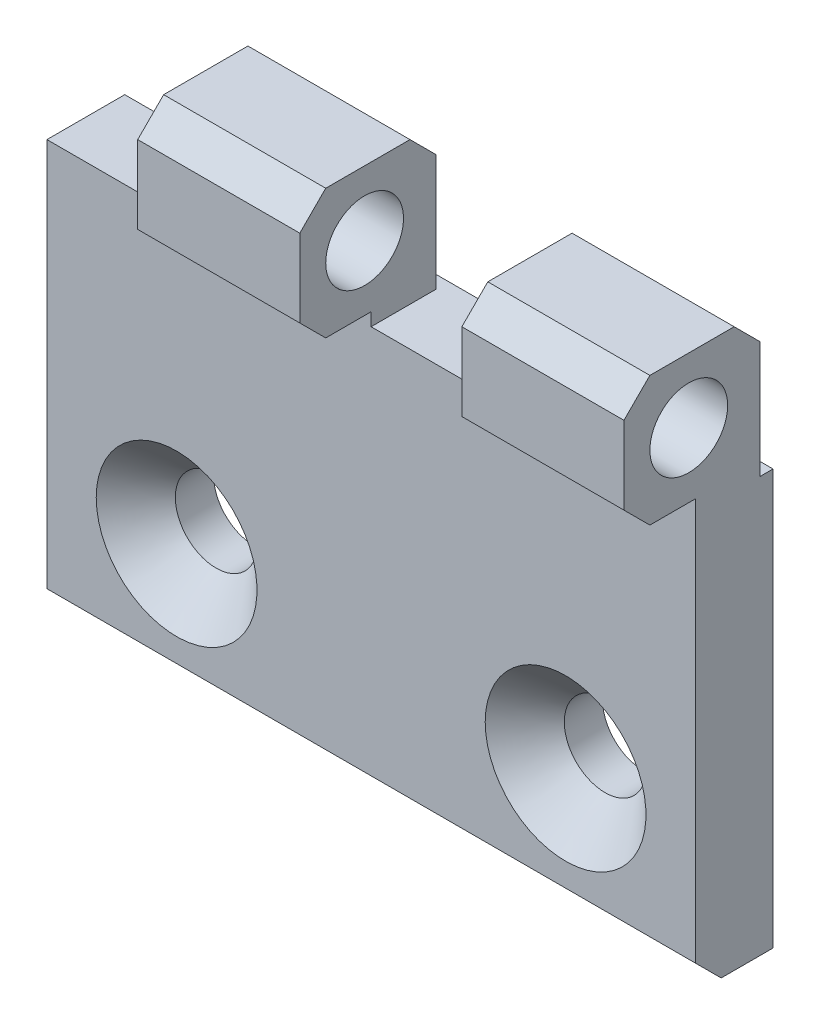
ISO-10303-21;
HEADER;
FILE_DESCRIPTION(('STEP AP214'),'2;1');
FILE_NAME('part.step','',(''),(''),'','','');
FILE_SCHEMA(('AUTOMOTIVE_DESIGN { 1 0 10303 214 1 1 1 1 }'));
ENDSEC;
DATA;
#1=APPLICATION_CONTEXT('core data for automotive mechanical design processes');
#2=APPLICATION_PROTOCOL_DEFINITION('international standard','automotive_design',2000,#1);
#3=PRODUCT_CONTEXT('',#1,'mechanical');
#4=PRODUCT('Part','Part','',(#3));
#5=PRODUCT_RELATED_PRODUCT_CATEGORY('part','',(#4));
#6=PRODUCT_DEFINITION_FORMATION('','',#4);
#7=PRODUCT_DEFINITION_CONTEXT('part definition',#1,'design');
#8=PRODUCT_DEFINITION('design','',#6,#7);
#9=PRODUCT_DEFINITION_SHAPE('','',#8);
#10=(LENGTH_UNIT() NAMED_UNIT(*) SI_UNIT(.MILLI.,.METRE.));
#11=(NAMED_UNIT(*) PLANE_ANGLE_UNIT() SI_UNIT($,.RADIAN.));
#12=(NAMED_UNIT(*) SI_UNIT($,.STERADIAN.) SOLID_ANGLE_UNIT());
#13=UNCERTAINTY_MEASURE_WITH_UNIT(LENGTH_MEASURE(1.E-05),#10,'distance_accuracy_value','');
#14=(GEOMETRIC_REPRESENTATION_CONTEXT(3) GLOBAL_UNCERTAINTY_ASSIGNED_CONTEXT((#13)) GLOBAL_UNIT_ASSIGNED_CONTEXT((#10,
#11,#12)) REPRESENTATION_CONTEXT('',''));
#15=CARTESIAN_POINT('',(0.,0.,0.));
#16=DIRECTION('',(0.,0.,1.));
#17=DIRECTION('',(1.,0.,0.));
#18=AXIS2_PLACEMENT_3D('',#15,#16,#17);
#19=CARTESIAN_POINT('',(-10.,-10.,6.));
#20=DIRECTION('',(0.,0.,-1.));
#21=DIRECTION('',(-1.,0.,0.));
#22=AXIS2_PLACEMENT_3D('',#19,#20,#21);
#23=PLANE('',#22);
#24=CARTESIAN_POINT('',(30.,0.,6.));
#25=DIRECTION('',(0.,0.,-1.));
#26=DIRECTION('',(-1.,0.,0.));
#27=AXIS2_PLACEMENT_3D('',#24,#25,#26);
#28=CIRCLE('',#27,6.2);
#29=CARTESIAN_POINT('',(23.8,0.,6.));
#30=VERTEX_POINT('',#29);
#31=EDGE_CURVE('E348',#30,#30,#28,.T.);
#32=ORIENTED_EDGE('',*,*,#31,.T.);
#33=EDGE_LOOP('',(#32));
#34=FACE_BOUND('',#33,.T.);
#35=CARTESIAN_POINT('',(0.,0.,6.));
#36=DIRECTION('',(0.,0.,-1.));
#37=DIRECTION('',(-1.,0.,0.));
#38=AXIS2_PLACEMENT_3D('',#35,#36,#37);
#39=CIRCLE('',#38,6.2);
#40=CARTESIAN_POINT('',(-6.2,0.,6.));
#41=VERTEX_POINT('',#40);
#42=EDGE_CURVE('E341',#41,#41,#39,.T.);
#43=ORIENTED_EDGE('',*,*,#42,.T.);
#44=EDGE_LOOP('',(#43));
#45=FACE_BOUND('',#44,.T.);
#46=DIRECTION('',(0.,1.,0.));
#47=VECTOR('',#46,1.);
#48=CARTESIAN_POINT('',(27.5,-10.,6.));
#49=LINE('',#48,#47);
#50=CARTESIAN_POINT('',(27.5,22.,6.));
#51=VERTEX_POINT('',#50);
#52=CARTESIAN_POINT('',(27.5,23.,6.));
#53=VERTEX_POINT('',#52);
#54=EDGE_CURVE('E267',#51,#53,#49,.T.);
#55=ORIENTED_EDGE('',*,*,#54,.F.);
#56=DIRECTION('',(-1.,0.,0.));
#57=VECTOR('',#56,1.);
#58=CARTESIAN_POINT('',(-10.,22.,6.));
#59=LINE('',#58,#57);
#60=CARTESIAN_POINT('',(15.,22.,6.));
#61=VERTEX_POINT('',#60);
#62=EDGE_CURVE('E272',#51,#61,#59,.T.);
#63=ORIENTED_EDGE('',*,*,#62,.T.);
#64=DIRECTION('',(0.,1.,0.));
#65=VECTOR('',#64,1.);
#66=CARTESIAN_POINT('',(15.,-10.,6.));
#67=LINE('',#66,#65);
#68=CARTESIAN_POINT('',(15.,23.,6.));
#69=VERTEX_POINT('',#68);
#70=EDGE_CURVE('E257',#61,#69,#67,.T.);
#71=ORIENTED_EDGE('',*,*,#70,.T.);
#72=DIRECTION('',(1.,0.,0.));
#73=VECTOR('',#72,1.);
#74=CARTESIAN_POINT('',(-10.,23.,6.));
#75=LINE('',#74,#73);
#76=CARTESIAN_POINT('',(2.5,23.,6.));
#77=VERTEX_POINT('',#76);
#78=EDGE_CURVE('E316',#77,#69,#75,.T.);
#79=ORIENTED_EDGE('',*,*,#78,.F.);
#80=DIRECTION('',(0.,1.,0.));
#81=VECTOR('',#80,1.);
#82=CARTESIAN_POINT('',(2.5,-10.,6.));
#83=LINE('',#82,#81);
#84=CARTESIAN_POINT('',(2.5,22.,6.));
#85=VERTEX_POINT('',#84);
#86=EDGE_CURVE('E250',#85,#77,#83,.T.);
#87=ORIENTED_EDGE('',*,*,#86,.F.);
#88=DIRECTION('',(-1.,0.,0.));
#89=VECTOR('',#88,1.);
#90=CARTESIAN_POINT('',(-10.,22.,6.));
#91=LINE('',#90,#89);
#92=CARTESIAN_POINT('',(-10.,22.,6.));
#93=VERTEX_POINT('',#92);
#94=EDGE_CURVE('E269',#85,#93,#91,.T.);
#95=ORIENTED_EDGE('',*,*,#94,.T.);
#96=DIRECTION('',(0.,1.,0.));
#97=VECTOR('',#96,1.);
#98=CARTESIAN_POINT('',(-10.,-10.,6.));
#99=LINE('',#98,#97);
#100=CARTESIAN_POINT('',(-10.,-8.,6.));
#101=VERTEX_POINT('',#100);
#102=EDGE_CURVE('E298',#101,#93,#99,.T.);
#103=ORIENTED_EDGE('',*,*,#102,.F.);
#104=DIRECTION('',(1.,0.,0.));
#105=VECTOR('',#104,1.);
#106=CARTESIAN_POINT('',(-10.,-8.,6.));
#107=LINE('',#106,#105);
#108=CARTESIAN_POINT('',(40.,-8.,6.));
#109=VERTEX_POINT('',#108);
#110=EDGE_CURVE('E317',#101,#109,#107,.T.);
#111=ORIENTED_EDGE('',*,*,#110,.T.);
#112=DIRECTION('',(0.,1.,0.));
#113=VECTOR('',#112,1.);
#114=CARTESIAN_POINT('',(40.,-10.,6.));
#115=LINE('',#114,#113);
#116=CARTESIAN_POINT('',(40.,23.,6.));
#117=VERTEX_POINT('',#116);
#118=EDGE_CURVE('E278',#109,#117,#115,.T.);
#119=ORIENTED_EDGE('',*,*,#118,.T.);
#120=EDGE_CURVE('E314',#53,#117,#75,.T.);
#121=ORIENTED_EDGE('',*,*,#120,.F.);
#122=EDGE_LOOP('',(#55,#63,#71,#79,#87,#95,#103,#111,#119,#121));
#123=FACE_BOUND('',#122,.T.);
#124=ADVANCED_FACE('F14',(#34,#45,#123),#23,.F.);
#125=CARTESIAN_POINT('',(-10.,23.,11.));
#126=DIRECTION('',(0.,-1.,0.));
#127=DIRECTION('',(1.,0.,0.));
#128=AXIS2_PLACEMENT_3D('',#125,#126,#127);
#129=PLANE('',#128);
#130=DIRECTION('',(0.,0.,-1.));
#131=VECTOR('',#130,1.);
#132=CARTESIAN_POINT('',(40.,23.,11.));
#133=LINE('',#132,#131);
#134=CARTESIAN_POINT('',(40.,23.,9.5));
#135=VERTEX_POINT('',#134);
#136=EDGE_CURVE('E281',#135,#117,#133,.T.);
#137=ORIENTED_EDGE('',*,*,#136,.F.);
#138=DIRECTION('',(1.,0.,0.));
#139=VECTOR('',#138,1.);
#140=CARTESIAN_POINT('',(27.5,23.,9.5));
#141=LINE('',#140,#139);
#142=CARTESIAN_POINT('',(27.5,23.,9.5));
#143=VERTEX_POINT('',#142);
#144=EDGE_CURVE('E227',#143,#135,#141,.T.);
#145=ORIENTED_EDGE('',*,*,#144,.F.);
#146=DIRECTION('',(0.,0.,-1.));
#147=VECTOR('',#146,1.);
#148=CARTESIAN_POINT('',(27.5,23.,11.));
#149=LINE('',#148,#147);
#150=EDGE_CURVE('E264',#143,#53,#149,.T.);
#151=ORIENTED_EDGE('',*,*,#150,.T.);
#152=ORIENTED_EDGE('',*,*,#120,.T.);
#153=EDGE_LOOP('',(#137,#145,#151,#152));
#154=FACE_BOUND('',#153,.T.);
#155=ADVANCED_FACE('F367',(#154),#129,.T.);
#156=DIRECTION('',(0.,0.,-1.));
#157=VECTOR('',#156,1.);
#158=CARTESIAN_POINT('',(15.,23.,11.));
#159=LINE('',#158,#157);
#160=CARTESIAN_POINT('',(15.,23.,9.5));
#161=VERTEX_POINT('',#160);
#162=EDGE_CURVE('E255',#161,#69,#159,.T.);
#163=ORIENTED_EDGE('',*,*,#162,.F.);
#164=DIRECTION('',(1.,0.,0.));
#165=VECTOR('',#164,1.);
#166=CARTESIAN_POINT('',(2.5,23.,9.5));
#167=LINE('',#166,#165);
#168=CARTESIAN_POINT('',(2.5,23.,9.5));
#169=VERTEX_POINT('',#168);
#170=EDGE_CURVE('E202',#169,#161,#167,.T.);
#171=ORIENTED_EDGE('',*,*,#170,.F.);
#172=DIRECTION('',(0.,0.,-1.));
#173=VECTOR('',#172,1.);
#174=CARTESIAN_POINT('',(2.5,23.,11.));
#175=LINE('',#174,#173);
#176=EDGE_CURVE('E170',#169,#77,#175,.T.);
#177=ORIENTED_EDGE('',*,*,#176,.T.);
#178=ORIENTED_EDGE('',*,*,#78,.T.);
#179=EDGE_LOOP('',(#163,#171,#177,#178));
#180=FACE_BOUND('',#179,.T.);
#181=ADVANCED_FACE('F427',(#180),#129,.T.);
#182=CARTESIAN_POINT('',(-10.,33.,1.));
#183=DIRECTION('',(0.,1.,0.));
#184=DIRECTION('',(-1.,0.,0.));
#185=AXIS2_PLACEMENT_3D('',#182,#183,#184);
#186=PLANE('',#185);
#187=DIRECTION('',(-1.,0.,0.));
#188=VECTOR('',#187,1.);
#189=CARTESIAN_POINT('',(-10.,33.,3.));
#190=LINE('',#189,#188);
#191=CARTESIAN_POINT('',(40.,33.,3.));
#192=VERTEX_POINT('',#191);
#193=CARTESIAN_POINT('',(27.5,33.,3.));
#194=VERTEX_POINT('',#193);
#195=EDGE_CURVE('E328',#192,#194,#190,.T.);
#196=ORIENTED_EDGE('',*,*,#195,.T.);
#197=DIRECTION('',(0.,0.,1.));
#198=VECTOR('',#197,1.);
#199=CARTESIAN_POINT('',(27.5,33.,1.));
#200=LINE('',#199,#198);
#201=CARTESIAN_POINT('',(27.5,33.,9.5));
#202=VERTEX_POINT('',#201);
#203=EDGE_CURVE('E262',#194,#202,#200,.T.);
#204=ORIENTED_EDGE('',*,*,#203,.T.);
#205=DIRECTION('',(1.,0.,0.));
#206=VECTOR('',#205,1.);
#207=CARTESIAN_POINT('',(27.5,33.,9.5));
#208=LINE('',#207,#206);
#209=CARTESIAN_POINT('',(40.,33.,9.5));
#210=VERTEX_POINT('',#209);
#211=EDGE_CURVE('E219',#202,#210,#208,.T.);
#212=ORIENTED_EDGE('',*,*,#211,.T.);
#213=DIRECTION('',(0.,0.,1.));
#214=VECTOR('',#213,1.);
#215=CARTESIAN_POINT('',(40.,33.,1.));
#216=LINE('',#215,#214);
#217=EDGE_CURVE('E284',#192,#210,#216,.T.);
#218=ORIENTED_EDGE('',*,*,#217,.F.);
#219=EDGE_LOOP('',(#196,#204,#212,#218));
#220=FACE_BOUND('',#219,.T.);
#221=ADVANCED_FACE('F398',(#220),#186,.T.);
#222=DIRECTION('',(0.,0.,1.));
#223=VECTOR('',#222,1.);
#224=CARTESIAN_POINT('',(15.,33.,1.));
#225=LINE('',#224,#223);
#226=CARTESIAN_POINT('',(15.,33.,3.));
#227=VERTEX_POINT('',#226);
#228=CARTESIAN_POINT('',(15.,33.,9.5));
#229=VERTEX_POINT('',#228);
#230=EDGE_CURVE('E253',#227,#229,#225,.T.);
#231=ORIENTED_EDGE('',*,*,#230,.F.);
#232=CARTESIAN_POINT('',(2.5,33.,3.));
#233=VERTEX_POINT('',#232);
#234=EDGE_CURVE('E169',#227,#233,#190,.T.);
#235=ORIENTED_EDGE('',*,*,#234,.T.);
#236=DIRECTION('',(0.,0.,1.));
#237=VECTOR('',#236,1.);
#238=CARTESIAN_POINT('',(2.5,33.,1.));
#239=LINE('',#238,#237);
#240=CARTESIAN_POINT('',(2.5,33.,9.5));
#241=VERTEX_POINT('',#240);
#242=EDGE_CURVE('E37',#233,#241,#239,.T.);
#243=ORIENTED_EDGE('',*,*,#242,.T.);
#244=DIRECTION('',(1.,0.,0.));
#245=VECTOR('',#244,1.);
#246=CARTESIAN_POINT('',(2.5,33.,9.5));
#247=LINE('',#246,#245);
#248=EDGE_CURVE('E166',#241,#229,#247,.T.);
#249=ORIENTED_EDGE('',*,*,#248,.T.);
#250=EDGE_LOOP('',(#231,#235,#243,#249));
#251=FACE_BOUND('',#250,.T.);
#252=ADVANCED_FACE('F165',(#251),#186,.T.);
#253=CARTESIAN_POINT('',(-10.,33.,1.));
#254=DIRECTION('',(0.,0.,1.));
#255=DIRECTION('',(0.,-1.,0.));
#256=AXIS2_PLACEMENT_3D('',#253,#254,#255);
#257=PLANE('',#256);
#258=DIRECTION('',(0.,-1.,0.));
#259=VECTOR('',#258,1.);
#260=CARTESIAN_POINT('',(27.5,33.,1.));
#261=LINE('',#260,#259);
#262=CARTESIAN_POINT('',(27.5,31.,1.));
#263=VERTEX_POINT('',#262);
#264=CARTESIAN_POINT('',(27.5,22.,1.));
#265=VERTEX_POINT('',#264);
#266=EDGE_CURVE('E260',#263,#265,#261,.T.);
#267=ORIENTED_EDGE('',*,*,#266,.F.);
#268=DIRECTION('',(1.,0.,0.));
#269=VECTOR('',#268,1.);
#270=CARTESIAN_POINT('',(40.,31.,1.));
#271=LINE('',#270,#269);
#272=CARTESIAN_POINT('',(40.,31.,1.));
#273=VERTEX_POINT('',#272);
#274=EDGE_CURVE('E331',#263,#273,#271,.T.);
#275=ORIENTED_EDGE('',*,*,#274,.T.);
#276=DIRECTION('',(0.,-1.,0.));
#277=VECTOR('',#276,1.);
#278=CARTESIAN_POINT('',(40.,33.,1.));
#279=LINE('',#278,#277);
#280=CARTESIAN_POINT('',(40.,22.,1.));
#281=VERTEX_POINT('',#280);
#282=EDGE_CURVE('E286',#273,#281,#279,.T.);
#283=ORIENTED_EDGE('',*,*,#282,.T.);
#284=DIRECTION('',(1.,0.,0.));
#285=VECTOR('',#284,1.);
#286=CARTESIAN_POINT('',(-10.,22.,1.));
#287=LINE('',#286,#285);
#288=EDGE_CURVE('E311',#265,#281,#287,.T.);
#289=ORIENTED_EDGE('',*,*,#288,.F.);
#290=EDGE_LOOP('',(#267,#275,#283,#289));
#291=FACE_BOUND('',#290,.T.);
#292=ADVANCED_FACE('F405',(#291),#257,.F.);
#293=CARTESIAN_POINT('',(2.5,31.,1.));
#294=VERTEX_POINT('',#293);
#295=CARTESIAN_POINT('',(15.,31.,1.));
#296=VERTEX_POINT('',#295);
#297=EDGE_CURVE('E333',#294,#296,#271,.T.);
#298=ORIENTED_EDGE('',*,*,#297,.T.);
#299=DIRECTION('',(0.,-1.,0.));
#300=VECTOR('',#299,1.);
#301=CARTESIAN_POINT('',(15.,33.,1.));
#302=LINE('',#301,#300);
#303=CARTESIAN_POINT('',(15.,22.,1.));
#304=VERTEX_POINT('',#303);
#305=EDGE_CURVE('E29',#296,#304,#302,.T.);
#306=ORIENTED_EDGE('',*,*,#305,.T.);
#307=CARTESIAN_POINT('',(2.5,22.,1.));
#308=VERTEX_POINT('',#307);
#309=EDGE_CURVE('E313',#308,#304,#287,.T.);
#310=ORIENTED_EDGE('',*,*,#309,.F.);
#311=DIRECTION('',(0.,-1.,0.));
#312=VECTOR('',#311,1.);
#313=CARTESIAN_POINT('',(2.5,33.,1.));
#314=LINE('',#313,#312);
#315=EDGE_CURVE('E171',#294,#308,#314,.T.);
#316=ORIENTED_EDGE('',*,*,#315,.F.);
#317=EDGE_LOOP('',(#298,#306,#310,#316));
#318=FACE_BOUND('',#317,.T.);
#319=ADVANCED_FACE('F414',(#318),#257,.F.);
#320=CARTESIAN_POINT('',(-10.,31.,1.));
#321=DIRECTION('',(0.,0.707106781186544,-0.707106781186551));
#322=DIRECTION('',(0.,0.707106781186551,0.707106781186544));
#323=AXIS2_PLACEMENT_3D('',#320,#321,#322);
#324=PLANE('',#323);
#325=ORIENTED_EDGE('',*,*,#274,.F.);
#326=DIRECTION('',(0.,0.707106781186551,0.707106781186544));
#327=VECTOR('',#326,1.);
#328=CARTESIAN_POINT('',(27.5,31.,1.));
#329=LINE('',#328,#327);
#330=EDGE_CURVE('E338',#263,#194,#329,.T.);
#331=ORIENTED_EDGE('',*,*,#330,.T.);
#332=ORIENTED_EDGE('',*,*,#195,.F.);
#333=DIRECTION('',(0.,0.707106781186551,0.707106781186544));
#334=VECTOR('',#333,1.);
#335=CARTESIAN_POINT('',(40.,31.,1.));
#336=LINE('',#335,#334);
#337=EDGE_CURVE('E320',#273,#192,#336,.T.);
#338=ORIENTED_EDGE('',*,*,#337,.F.);
#339=EDGE_LOOP('',(#325,#331,#332,#338));
#340=FACE_BOUND('',#339,.T.);
#341=ADVANCED_FACE('F395',(#340),#324,.T.);
#342=DIRECTION('',(0.,0.707106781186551,0.707106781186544));
#343=VECTOR('',#342,1.);
#344=CARTESIAN_POINT('',(15.,31.,1.));
#345=LINE('',#344,#343);
#346=EDGE_CURVE('E336',#296,#227,#345,.T.);
#347=ORIENTED_EDGE('',*,*,#346,.F.);
#348=ORIENTED_EDGE('',*,*,#297,.F.);
#349=DIRECTION('',(0.,0.707106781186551,0.707106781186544));
#350=VECTOR('',#349,1.);
#351=CARTESIAN_POINT('',(2.5,31.,1.));
#352=LINE('',#351,#350);
#353=EDGE_CURVE('E334',#294,#233,#352,.T.);
#354=ORIENTED_EDGE('',*,*,#353,.T.);
#355=ORIENTED_EDGE('',*,*,#234,.F.);
#356=EDGE_LOOP('',(#347,#348,#354,#355));
#357=FACE_BOUND('',#356,.T.);
#358=ADVANCED_FACE('F418',(#357),#324,.T.);
#359=CARTESIAN_POINT('',(-10.,-10.,0.));
#360=DIRECTION('',(0.,1.,0.));
#361=DIRECTION('',(-1.,0.,0.));
#362=AXIS2_PLACEMENT_3D('',#359,#360,#361);
#363=PLANE('',#362);
#364=DIRECTION('',(0.,0.,1.));
#365=VECTOR('',#364,1.);
#366=CARTESIAN_POINT('',(40.,-10.,0.));
#367=LINE('',#366,#365);
#368=CARTESIAN_POINT('',(40.,-10.,0.));
#369=VERTEX_POINT('',#368);
#370=CARTESIAN_POINT('',(40.,-10.,4.));
#371=VERTEX_POINT('',#370);
#372=EDGE_CURVE('E275',#369,#371,#367,.T.);
#373=ORIENTED_EDGE('',*,*,#372,.T.);
#374=DIRECTION('',(-1.,0.,0.));
#375=VECTOR('',#374,1.);
#376=CARTESIAN_POINT('',(-10.,-10.,4.));
#377=LINE('',#376,#375);
#378=CARTESIAN_POINT('',(-10.,-10.,4.));
#379=VERTEX_POINT('',#378);
#380=EDGE_CURVE('E324',#371,#379,#377,.T.);
#381=ORIENTED_EDGE('',*,*,#380,.T.);
#382=DIRECTION('',(0.,0.,1.));
#383=VECTOR('',#382,1.);
#384=CARTESIAN_POINT('',(-10.,-10.,0.));
#385=LINE('',#384,#383);
#386=CARTESIAN_POINT('',(-10.,-10.,0.));
#387=VERTEX_POINT('',#386);
#388=EDGE_CURVE('E295',#387,#379,#385,.T.);
#389=ORIENTED_EDGE('',*,*,#388,.F.);
#390=DIRECTION('',(1.,0.,0.));
#391=VECTOR('',#390,1.);
#392=CARTESIAN_POINT('',(-10.,-10.,0.));
#393=LINE('',#392,#391);
#394=EDGE_CURVE('E307',#387,#369,#393,.T.);
#395=ORIENTED_EDGE('',*,*,#394,.T.);
#396=EDGE_LOOP('',(#373,#381,#389,#395));
#397=FACE_BOUND('',#396,.T.);
#398=ADVANCED_FACE('F441',(#397),#363,.F.);
#399=CARTESIAN_POINT('',(-10.,22.,1.));
#400=DIRECTION('',(0.,-1.,0.));
#401=DIRECTION('',(0.,0.,-1.));
#402=AXIS2_PLACEMENT_3D('',#399,#400,#401);
#403=PLANE('',#402);
#404=DIRECTION('',(0.,0.,-1.));
#405=VECTOR('',#404,1.);
#406=CARTESIAN_POINT('',(-10.,22.,1.));
#407=LINE('',#406,#405);
#408=CARTESIAN_POINT('',(-10.,22.,0.));
#409=VERTEX_POINT('',#408);
#410=EDGE_CURVE('E301',#93,#409,#407,.T.);
#411=ORIENTED_EDGE('',*,*,#410,.F.);
#412=ORIENTED_EDGE('',*,*,#94,.F.);
#413=DIRECTION('',(0.,0.,1.));
#414=VECTOR('',#413,1.);
#415=CARTESIAN_POINT('',(2.5,22.,-9.));
#416=LINE('',#415,#414);
#417=EDGE_CURVE('E237',#308,#85,#416,.T.);
#418=ORIENTED_EDGE('',*,*,#417,.F.);
#419=ORIENTED_EDGE('',*,*,#309,.T.);
#420=DIRECTION('',(0.,0.,1.));
#421=VECTOR('',#420,1.);
#422=CARTESIAN_POINT('',(15.,22.,-9.));
#423=LINE('',#422,#421);
#424=EDGE_CURVE('E240',#304,#61,#423,.T.);
#425=ORIENTED_EDGE('',*,*,#424,.T.);
#426=ORIENTED_EDGE('',*,*,#62,.F.);
#427=DIRECTION('',(0.,0.,1.));
#428=VECTOR('',#427,1.);
#429=CARTESIAN_POINT('',(27.5,22.,-9.));
#430=LINE('',#429,#428);
#431=EDGE_CURVE('E244',#265,#51,#430,.T.);
#432=ORIENTED_EDGE('',*,*,#431,.F.);
#433=ORIENTED_EDGE('',*,*,#288,.T.);
#434=DIRECTION('',(0.,0.,-1.));
#435=VECTOR('',#434,1.);
#436=CARTESIAN_POINT('',(40.,22.,1.));
#437=LINE('',#436,#435);
#438=CARTESIAN_POINT('',(40.,22.,0.));
#439=VERTEX_POINT('',#438);
#440=EDGE_CURVE('E289',#281,#439,#437,.T.);
#441=ORIENTED_EDGE('',*,*,#440,.T.);
#442=DIRECTION('',(1.,0.,0.));
#443=VECTOR('',#442,1.);
#444=CARTESIAN_POINT('',(-10.,22.,0.));
#445=LINE('',#444,#443);
#446=EDGE_CURVE('E309',#409,#439,#445,.T.);
#447=ORIENTED_EDGE('',*,*,#446,.F.);
#448=EDGE_LOOP('',(#411,#412,#418,#419,#425,#426,#432,#433,#441,#447));
#449=FACE_BOUND('',#448,.T.);
#450=ADVANCED_FACE('F407',(#449),#403,.F.);
#451=CARTESIAN_POINT('',(-10.,-10.,0.));
#452=DIRECTION('',(0.,0.,-1.));
#453=DIRECTION('',(-1.,0.,0.));
#454=AXIS2_PLACEMENT_3D('',#451,#452,#453);
#455=PLANE('',#454);
#456=CARTESIAN_POINT('',(0.,0.,0.));
#457=DIRECTION('',(0.,0.,-1.));
#458=DIRECTION('',(-1.,0.,0.));
#459=AXIS2_PLACEMENT_3D('',#456,#457,#458);
#460=CIRCLE('',#459,3.15);
#461=CARTESIAN_POINT('',(-3.15,0.,0.));
#462=VERTEX_POINT('',#461);
#463=EDGE_CURVE('E230',#462,#462,#460,.T.);
#464=ORIENTED_EDGE('',*,*,#463,.F.);
#465=EDGE_LOOP('',(#464));
#466=FACE_BOUND('',#465,.T.);
#467=CARTESIAN_POINT('',(30.,0.,0.));
#468=DIRECTION('',(0.,0.,-1.));
#469=DIRECTION('',(-1.,0.,0.));
#470=AXIS2_PLACEMENT_3D('',#467,#468,#469);
#471=CIRCLE('',#470,3.15);
#472=CARTESIAN_POINT('',(26.85,0.,0.));
#473=VERTEX_POINT('',#472);
#474=EDGE_CURVE('E241',#473,#473,#471,.T.);
#475=ORIENTED_EDGE('',*,*,#474,.F.);
#476=EDGE_LOOP('',(#475));
#477=FACE_BOUND('',#476,.T.);
#478=DIRECTION('',(0.,1.,0.));
#479=VECTOR('',#478,1.);
#480=CARTESIAN_POINT('',(-10.,-10.,0.));
#481=LINE('',#480,#479);
#482=EDGE_CURVE('E304',#387,#409,#481,.T.);
#483=ORIENTED_EDGE('',*,*,#482,.T.);
#484=ORIENTED_EDGE('',*,*,#446,.T.);
#485=DIRECTION('',(0.,1.,0.));
#486=VECTOR('',#485,1.);
#487=CARTESIAN_POINT('',(40.,-10.,0.));
#488=LINE('',#487,#486);
#489=EDGE_CURVE('E292',#369,#439,#488,.T.);
#490=ORIENTED_EDGE('',*,*,#489,.F.);
#491=ORIENTED_EDGE('',*,*,#394,.F.);
#492=EDGE_LOOP('',(#483,#484,#490,#491));
#493=FACE_BOUND('',#492,.T.);
#494=ADVANCED_FACE('F436',(#466,#477,#493),#455,.T.);
#495=CARTESIAN_POINT('',(-10.,-10.,6.));
#496=DIRECTION('',(-1.,0.,0.));
#497=DIRECTION('',(0.,-1.,0.));
#498=AXIS2_PLACEMENT_3D('',#495,#496,#497);
#499=PLANE('',#498);
#500=ORIENTED_EDGE('',*,*,#102,.T.);
#501=ORIENTED_EDGE('',*,*,#410,.T.);
#502=ORIENTED_EDGE('',*,*,#482,.F.);
#503=ORIENTED_EDGE('',*,*,#388,.T.);
#504=DIRECTION('',(0.,-0.707106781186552,-0.707106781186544));
#505=VECTOR('',#504,1.);
#506=CARTESIAN_POINT('',(-10.,-9.,5.));
#507=LINE('',#506,#505);
#508=EDGE_CURVE('E326',#379,#101,#507,.F.);
#509=ORIENTED_EDGE('',*,*,#508,.T.);
#510=EDGE_LOOP('',(#500,#501,#502,#503,#509));
#511=FACE_BOUND('',#510,.T.);
#512=ADVANCED_FACE('F434',(#511),#499,.T.);
#513=CARTESIAN_POINT('',(40.,-10.,6.));
#514=DIRECTION('',(-1.,0.,0.));
#515=DIRECTION('',(0.,-1.,0.));
#516=AXIS2_PLACEMENT_3D('',#513,#514,#515);
#517=PLANE('',#516);
#518=CARTESIAN_POINT('',(40.,28.,6.5));
#519=DIRECTION('',(1.,0.,0.));
#520=DIRECTION('',(0.,0.,-1.));
#521=AXIS2_PLACEMENT_3D('',#518,#519,#520);
#522=CIRCLE('',#521,3.);
#523=CARTESIAN_POINT('',(40.,28.,3.5));
#524=VERTEX_POINT('',#523);
#525=EDGE_CURVE('E684',#524,#524,#522,.T.);
#526=ORIENTED_EDGE('',*,*,#525,.F.);
#527=EDGE_LOOP('',(#526));
#528=FACE_BOUND('',#527,.T.);
#529=DIRECTION('',(0.,-0.707106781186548,-0.707106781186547));
#530=VECTOR('',#529,1.);
#531=CARTESIAN_POINT('',(40.,25.,11.5));
#532=LINE('',#531,#530);
#533=CARTESIAN_POINT('',(40.,25.,11.5));
#534=VERTEX_POINT('',#533);
#535=EDGE_CURVE('E213',#534,#135,#532,.T.);
#536=ORIENTED_EDGE('',*,*,#535,.T.);
#537=ORIENTED_EDGE('',*,*,#136,.T.);
#538=ORIENTED_EDGE('',*,*,#118,.F.);
#539=DIRECTION('',(0.,0.707106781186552,0.707106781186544));
#540=VECTOR('',#539,1.);
#541=CARTESIAN_POINT('',(40.,-8.,6.));
#542=LINE('',#541,#540);
#543=EDGE_CURVE('E322',#109,#371,#542,.F.);
#544=ORIENTED_EDGE('',*,*,#543,.T.);
#545=ORIENTED_EDGE('',*,*,#372,.F.);
#546=ORIENTED_EDGE('',*,*,#489,.T.);
#547=ORIENTED_EDGE('',*,*,#440,.F.);
#548=ORIENTED_EDGE('',*,*,#282,.F.);
#549=ORIENTED_EDGE('',*,*,#337,.T.);
#550=ORIENTED_EDGE('',*,*,#217,.T.);
#551=DIRECTION('',(0.,-0.707106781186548,0.707106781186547));
#552=VECTOR('',#551,1.);
#553=CARTESIAN_POINT('',(40.,33.,9.5));
#554=LINE('',#553,#552);
#555=CARTESIAN_POINT('',(40.,31.,11.5));
#556=VERTEX_POINT('',#555);
#557=EDGE_CURVE('E205',#210,#556,#554,.T.);
#558=ORIENTED_EDGE('',*,*,#557,.T.);
#559=DIRECTION('',(0.,-1.,0.));
#560=VECTOR('',#559,1.);
#561=CARTESIAN_POINT('',(40.,25.,11.5));
#562=LINE('',#561,#560);
#563=EDGE_CURVE('E222',#556,#534,#562,.T.);
#564=ORIENTED_EDGE('',*,*,#563,.T.);
#565=EDGE_LOOP('',(#536,#537,#538,#544,#545,#546,#547,#548,#549,#550,#558,#564));
#566=FACE_BOUND('',#565,.T.);
#567=ADVANCED_FACE('F400',(#528,#566),#517,.F.);
#568=CARTESIAN_POINT('',(-10.,-8.,6.));
#569=DIRECTION('',(0.,0.707106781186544,-0.707106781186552));
#570=DIRECTION('',(0.,0.707106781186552,0.707106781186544));
#571=AXIS2_PLACEMENT_3D('',#568,#569,#570);
#572=PLANE('',#571);
#573=ORIENTED_EDGE('',*,*,#508,.F.);
#574=ORIENTED_EDGE('',*,*,#380,.F.);
#575=ORIENTED_EDGE('',*,*,#543,.F.);
#576=ORIENTED_EDGE('',*,*,#110,.F.);
#577=EDGE_LOOP('',(#573,#574,#575,#576));
#578=FACE_BOUND('',#577,.T.);
#579=ADVANCED_FACE('F446',(#578),#572,.F.);
#580=CARTESIAN_POINT('',(2.5,48.,-9.));
#581=DIRECTION('',(-1.,0.,0.));
#582=DIRECTION('',(0.,-1.,0.));
#583=AXIS2_PLACEMENT_3D('',#580,#581,#582);
#584=PLANE('',#583);
#585=CARTESIAN_POINT('',(2.5,28.,6.5));
#586=DIRECTION('',(-1.,0.,0.));
#587=DIRECTION('',(0.,0.,1.));
#588=AXIS2_PLACEMENT_3D('',#585,#586,#587);
#589=CIRCLE('',#588,3.);
#590=CARTESIAN_POINT('',(2.5,28.,9.5));
#591=VERTEX_POINT('',#590);
#592=EDGE_CURVE('E194',#591,#591,#589,.T.);
#593=ORIENTED_EDGE('',*,*,#592,.F.);
#594=EDGE_LOOP('',(#593));
#595=FACE_BOUND('',#594,.T.);
#596=DIRECTION('',(0.,-0.707106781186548,0.707106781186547));
#597=VECTOR('',#596,1.);
#598=CARTESIAN_POINT('',(2.5,33.,9.5));
#599=LINE('',#598,#597);
#600=CARTESIAN_POINT('',(2.5,31.,11.5));
#601=VERTEX_POINT('',#600);
#602=EDGE_CURVE('E176',#241,#601,#599,.T.);
#603=ORIENTED_EDGE('',*,*,#602,.F.);
#604=ORIENTED_EDGE('',*,*,#242,.F.);
#605=ORIENTED_EDGE('',*,*,#353,.F.);
#606=ORIENTED_EDGE('',*,*,#315,.T.);
#607=ORIENTED_EDGE('',*,*,#417,.T.);
#608=ORIENTED_EDGE('',*,*,#86,.T.);
#609=ORIENTED_EDGE('',*,*,#176,.F.);
#610=DIRECTION('',(0.,-0.707106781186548,-0.707106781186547));
#611=VECTOR('',#610,1.);
#612=CARTESIAN_POINT('',(2.5,25.,11.5));
#613=LINE('',#612,#611);
#614=CARTESIAN_POINT('',(2.5,25.,11.5));
#615=VERTEX_POINT('',#614);
#616=EDGE_CURVE('E180',#615,#169,#613,.T.);
#617=ORIENTED_EDGE('',*,*,#616,.F.);
#618=DIRECTION('',(0.,-1.,0.));
#619=VECTOR('',#618,1.);
#620=CARTESIAN_POINT('',(2.5,25.,11.5));
#621=LINE('',#620,#619);
#622=EDGE_CURVE('E186',#601,#615,#621,.T.);
#623=ORIENTED_EDGE('',*,*,#622,.F.);
#624=EDGE_LOOP('',(#603,#604,#605,#606,#607,#608,#609,#617,#623));
#625=FACE_BOUND('',#624,.T.);
#626=ADVANCED_FACE('F183',(#595,#625),#584,.T.);
#627=CARTESIAN_POINT('',(27.5,48.,-9.));
#628=DIRECTION('',(-1.,0.,0.));
#629=DIRECTION('',(0.,-1.,0.));
#630=AXIS2_PLACEMENT_3D('',#627,#628,#629);
#631=PLANE('',#630);
#632=CARTESIAN_POINT('',(27.5,28.,6.5));
#633=DIRECTION('',(-1.,0.,0.));
#634=DIRECTION('',(0.,0.,1.));
#635=AXIS2_PLACEMENT_3D('',#632,#633,#634);
#636=CIRCLE('',#635,3.);
#637=CARTESIAN_POINT('',(27.5,28.,9.5));
#638=VERTEX_POINT('',#637);
#639=EDGE_CURVE('E681',#638,#638,#636,.T.);
#640=ORIENTED_EDGE('',*,*,#639,.F.);
#641=EDGE_LOOP('',(#640));
#642=FACE_BOUND('',#641,.T.);
#643=ORIENTED_EDGE('',*,*,#150,.F.);
#644=DIRECTION('',(0.,-0.707106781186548,-0.707106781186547));
#645=VECTOR('',#644,1.);
#646=CARTESIAN_POINT('',(27.5,25.,11.5));
#647=LINE('',#646,#645);
#648=CARTESIAN_POINT('',(27.5,25.,11.5));
#649=VERTEX_POINT('',#648);
#650=EDGE_CURVE('E216',#649,#143,#647,.T.);
#651=ORIENTED_EDGE('',*,*,#650,.F.);
#652=DIRECTION('',(0.,-1.,0.));
#653=VECTOR('',#652,1.);
#654=CARTESIAN_POINT('',(27.5,25.,11.5));
#655=LINE('',#654,#653);
#656=CARTESIAN_POINT('',(27.5,31.,11.5));
#657=VERTEX_POINT('',#656);
#658=EDGE_CURVE('E212',#657,#649,#655,.T.);
#659=ORIENTED_EDGE('',*,*,#658,.F.);
#660=DIRECTION('',(0.,-0.707106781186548,0.707106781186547));
#661=VECTOR('',#660,1.);
#662=CARTESIAN_POINT('',(27.5,33.,9.5));
#663=LINE('',#662,#661);
#664=EDGE_CURVE('E209',#202,#657,#663,.T.);
#665=ORIENTED_EDGE('',*,*,#664,.F.);
#666=ORIENTED_EDGE('',*,*,#203,.F.);
#667=ORIENTED_EDGE('',*,*,#330,.F.);
#668=ORIENTED_EDGE('',*,*,#266,.T.);
#669=ORIENTED_EDGE('',*,*,#431,.T.);
#670=ORIENTED_EDGE('',*,*,#54,.T.);
#671=EDGE_LOOP('',(#643,#651,#659,#665,#666,#667,#668,#669,#670));
#672=FACE_BOUND('',#671,.T.);
#673=ADVANCED_FACE('F373',(#642,#672),#631,.T.);
#674=CARTESIAN_POINT('',(15.,48.,-9.));
#675=DIRECTION('',(-1.,0.,0.));
#676=DIRECTION('',(0.,-1.,0.));
#677=AXIS2_PLACEMENT_3D('',#674,#675,#676);
#678=PLANE('',#677);
#679=CARTESIAN_POINT('',(15.,28.,6.5));
#680=DIRECTION('',(-1.,0.,0.));
#681=DIRECTION('',(0.,0.,1.));
#682=AXIS2_PLACEMENT_3D('',#679,#680,#681);
#683=CIRCLE('',#682,3.);
#684=CARTESIAN_POINT('',(15.,28.,9.5));
#685=VERTEX_POINT('',#684);
#686=EDGE_CURVE('E17',#685,#685,#683,.T.);
#687=ORIENTED_EDGE('',*,*,#686,.T.);
#688=EDGE_LOOP('',(#687));
#689=FACE_BOUND('',#688,.T.);
#690=ORIENTED_EDGE('',*,*,#230,.T.);
#691=DIRECTION('',(0.,-0.707106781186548,0.707106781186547));
#692=VECTOR('',#691,1.);
#693=CARTESIAN_POINT('',(15.,33.,9.5));
#694=LINE('',#693,#692);
#695=CARTESIAN_POINT('',(15.,31.,11.5));
#696=VERTEX_POINT('',#695);
#697=EDGE_CURVE('E178',#229,#696,#694,.T.);
#698=ORIENTED_EDGE('',*,*,#697,.T.);
#699=DIRECTION('',(0.,-1.,0.));
#700=VECTOR('',#699,1.);
#701=CARTESIAN_POINT('',(15.,25.,11.5));
#702=LINE('',#701,#700);
#703=CARTESIAN_POINT('',(15.,25.,11.5));
#704=VERTEX_POINT('',#703);
#705=EDGE_CURVE('E191',#696,#704,#702,.T.);
#706=ORIENTED_EDGE('',*,*,#705,.T.);
#707=DIRECTION('',(0.,-0.707106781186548,-0.707106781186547));
#708=VECTOR('',#707,1.);
#709=CARTESIAN_POINT('',(15.,25.,11.5));
#710=LINE('',#709,#708);
#711=EDGE_CURVE('E187',#704,#161,#710,.T.);
#712=ORIENTED_EDGE('',*,*,#711,.T.);
#713=ORIENTED_EDGE('',*,*,#162,.T.);
#714=ORIENTED_EDGE('',*,*,#70,.F.);
#715=ORIENTED_EDGE('',*,*,#424,.F.);
#716=ORIENTED_EDGE('',*,*,#305,.F.);
#717=ORIENTED_EDGE('',*,*,#346,.T.);
#718=EDGE_LOOP('',(#690,#698,#706,#712,#713,#714,#715,#716,#717));
#719=FACE_BOUND('',#718,.T.);
#720=ADVANCED_FACE('F411',(#689,#719),#678,.F.);
#721=CARTESIAN_POINT('',(30.,0.,6.));
#722=DIRECTION('',(0.,0.,-1.));
#723=DIRECTION('',(-1.,0.,0.));
#724=AXIS2_PLACEMENT_3D('',#721,#722,#723);
#725=CYLINDRICAL_SURFACE('',#724,3.15);
#726=CARTESIAN_POINT('',(30.,0.,2.95));
#727=DIRECTION('',(0.,0.,-1.));
#728=DIRECTION('',(-1.,0.,0.));
#729=AXIS2_PLACEMENT_3D('',#726,#727,#728);
#730=CIRCLE('',#729,3.15);
#731=CARTESIAN_POINT('',(26.85,0.,2.95));
#732=VERTEX_POINT('',#731);
#733=EDGE_CURVE('E22',#732,#732,#730,.F.);
#734=ORIENTED_EDGE('',*,*,#733,.T.);
#735=EDGE_LOOP('',(#734));
#736=FACE_BOUND('',#735,.T.);
#737=ORIENTED_EDGE('',*,*,#474,.T.);
#738=EDGE_LOOP('',(#737));
#739=FACE_BOUND('',#738,.T.);
#740=ADVANCED_FACE('F354',(#736,#739),#725,.F.);
#741=CARTESIAN_POINT('',(0.,0.,6.));
#742=DIRECTION('',(0.,0.,-1.));
#743=DIRECTION('',(-1.,0.,0.));
#744=AXIS2_PLACEMENT_3D('',#741,#742,#743);
#745=CYLINDRICAL_SURFACE('',#744,3.15);
#746=CARTESIAN_POINT('',(0.,0.,2.95));
#747=DIRECTION('',(0.,0.,-1.));
#748=DIRECTION('',(-1.,0.,0.));
#749=AXIS2_PLACEMENT_3D('',#746,#747,#748);
#750=CIRCLE('',#749,3.15);
#751=CARTESIAN_POINT('',(-3.15,0.,2.95));
#752=VERTEX_POINT('',#751);
#753=EDGE_CURVE('E9',#752,#752,#750,.F.);
#754=ORIENTED_EDGE('',*,*,#753,.T.);
#755=EDGE_LOOP('',(#754));
#756=FACE_BOUND('',#755,.T.);
#757=ORIENTED_EDGE('',*,*,#463,.T.);
#758=EDGE_LOOP('',(#757));
#759=FACE_BOUND('',#758,.T.);
#760=ADVANCED_FACE('F361',(#756,#759),#745,.F.);
#761=CARTESIAN_POINT('',(30.,0.,6.));
#762=DIRECTION('',(0.,0.,1.));
#763=DIRECTION('',(1.,0.,0.));
#764=AXIS2_PLACEMENT_3D('',#761,#762,#763);
#765=CONICAL_SURFACE('',#764,6.2,0.785398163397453);
#766=ORIENTED_EDGE('',*,*,#733,.F.);
#767=EDGE_LOOP('',(#766));
#768=FACE_BOUND('',#767,.T.);
#769=ORIENTED_EDGE('',*,*,#31,.F.);
#770=EDGE_LOOP('',(#769));
#771=FACE_BOUND('',#770,.T.);
#772=ADVANCED_FACE('F357',(#768,#771),#765,.F.);
#773=CARTESIAN_POINT('',(0.,0.,6.));
#774=DIRECTION('',(0.,0.,1.));
#775=DIRECTION('',(1.,0.,0.));
#776=AXIS2_PLACEMENT_3D('',#773,#774,#775);
#777=CONICAL_SURFACE('',#776,6.2,0.785398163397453);
#778=ORIENTED_EDGE('',*,*,#753,.F.);
#779=EDGE_LOOP('',(#778));
#780=FACE_BOUND('',#779,.T.);
#781=ORIENTED_EDGE('',*,*,#42,.F.);
#782=EDGE_LOOP('',(#781));
#783=FACE_BOUND('',#782,.T.);
#784=ADVANCED_FACE('F360',(#780,#783),#777,.F.);
#785=CARTESIAN_POINT('',(27.5,25.,11.5));
#786=DIRECTION('',(0.,-0.707106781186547,0.707106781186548));
#787=DIRECTION('',(0.,-0.707106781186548,-0.707106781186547));
#788=AXIS2_PLACEMENT_3D('',#785,#786,#787);
#789=PLANE('',#788);
#790=ORIENTED_EDGE('',*,*,#535,.F.);
#791=DIRECTION('',(1.,0.,0.));
#792=VECTOR('',#791,1.);
#793=CARTESIAN_POINT('',(27.5,25.,11.5));
#794=LINE('',#793,#792);
#795=EDGE_CURVE('E231',#649,#534,#794,.T.);
#796=ORIENTED_EDGE('',*,*,#795,.F.);
#797=ORIENTED_EDGE('',*,*,#650,.T.);
#798=ORIENTED_EDGE('',*,*,#144,.T.);
#799=EDGE_LOOP('',(#790,#796,#797,#798));
#800=FACE_BOUND('',#799,.T.);
#801=ADVANCED_FACE('F380',(#800),#789,.T.);
#802=CARTESIAN_POINT('',(27.5,25.,11.5));
#803=DIRECTION('',(0.,0.,1.));
#804=DIRECTION('',(1.,0.,0.));
#805=AXIS2_PLACEMENT_3D('',#802,#803,#804);
#806=PLANE('',#805);
#807=ORIENTED_EDGE('',*,*,#563,.F.);
#808=DIRECTION('',(1.,0.,0.));
#809=VECTOR('',#808,1.);
#810=CARTESIAN_POINT('',(27.5,31.,11.5));
#811=LINE('',#810,#809);
#812=EDGE_CURVE('E233',#657,#556,#811,.T.);
#813=ORIENTED_EDGE('',*,*,#812,.F.);
#814=ORIENTED_EDGE('',*,*,#658,.T.);
#815=ORIENTED_EDGE('',*,*,#795,.T.);
#816=EDGE_LOOP('',(#807,#813,#814,#815));
#817=FACE_BOUND('',#816,.T.);
#818=ADVANCED_FACE('F385',(#817),#806,.T.);
#819=CARTESIAN_POINT('',(27.5,33.,9.5));
#820=DIRECTION('',(0.,0.707106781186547,0.707106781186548));
#821=DIRECTION('',(0.,-0.707106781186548,0.707106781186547));
#822=AXIS2_PLACEMENT_3D('',#819,#820,#821);
#823=PLANE('',#822);
#824=ORIENTED_EDGE('',*,*,#557,.F.);
#825=ORIENTED_EDGE('',*,*,#211,.F.);
#826=ORIENTED_EDGE('',*,*,#664,.T.);
#827=ORIENTED_EDGE('',*,*,#812,.T.);
#828=EDGE_LOOP('',(#824,#825,#826,#827));
#829=FACE_BOUND('',#828,.T.);
#830=ADVANCED_FACE('F388',(#829),#823,.T.);
#831=CARTESIAN_POINT('',(2.5,25.,11.5));
#832=DIRECTION('',(0.,-0.707106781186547,0.707106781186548));
#833=DIRECTION('',(0.,-0.707106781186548,-0.707106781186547));
#834=AXIS2_PLACEMENT_3D('',#831,#832,#833);
#835=PLANE('',#834);
#836=ORIENTED_EDGE('',*,*,#711,.F.);
#837=DIRECTION('',(1.,0.,0.));
#838=VECTOR('',#837,1.);
#839=CARTESIAN_POINT('',(2.5,25.,11.5));
#840=LINE('',#839,#838);
#841=EDGE_CURVE('E206',#615,#704,#840,.T.);
#842=ORIENTED_EDGE('',*,*,#841,.F.);
#843=ORIENTED_EDGE('',*,*,#616,.T.);
#844=ORIENTED_EDGE('',*,*,#170,.T.);
#845=EDGE_LOOP('',(#836,#842,#843,#844));
#846=FACE_BOUND('',#845,.T.);
#847=ADVANCED_FACE('F424',(#846),#835,.T.);
#848=CARTESIAN_POINT('',(2.5,25.,11.5));
#849=DIRECTION('',(0.,0.,1.));
#850=DIRECTION('',(1.,0.,0.));
#851=AXIS2_PLACEMENT_3D('',#848,#849,#850);
#852=PLANE('',#851);
#853=ORIENTED_EDGE('',*,*,#705,.F.);
#854=DIRECTION('',(1.,0.,0.));
#855=VECTOR('',#854,1.);
#856=CARTESIAN_POINT('',(2.5,31.,11.5));
#857=LINE('',#856,#855);
#858=EDGE_CURVE('E179',#601,#696,#857,.T.);
#859=ORIENTED_EDGE('',*,*,#858,.F.);
#860=ORIENTED_EDGE('',*,*,#622,.T.);
#861=ORIENTED_EDGE('',*,*,#841,.T.);
#862=EDGE_LOOP('',(#853,#859,#860,#861));
#863=FACE_BOUND('',#862,.T.);
#864=ADVANCED_FACE('F422',(#863),#852,.T.);
#865=CARTESIAN_POINT('',(2.5,33.,9.5));
#866=DIRECTION('',(0.,0.707106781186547,0.707106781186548));
#867=DIRECTION('',(0.,-0.707106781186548,0.707106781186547));
#868=AXIS2_PLACEMENT_3D('',#865,#866,#867);
#869=PLANE('',#868);
#870=ORIENTED_EDGE('',*,*,#697,.F.);
#871=ORIENTED_EDGE('',*,*,#248,.F.);
#872=ORIENTED_EDGE('',*,*,#602,.T.);
#873=ORIENTED_EDGE('',*,*,#858,.T.);
#874=EDGE_LOOP('',(#870,#871,#872,#873));
#875=FACE_BOUND('',#874,.T.);
#876=ADVANCED_FACE('F175',(#875),#869,.T.);
#877=CARTESIAN_POINT('',(-10.,28.,6.5));
#878=DIRECTION('',(1.,0.,0.));
#879=DIRECTION('',(0.,0.,-1.));
#880=AXIS2_PLACEMENT_3D('',#877,#878,#879);
#881=CYLINDRICAL_SURFACE('',#880,3.);
#882=ORIENTED_EDGE('',*,*,#592,.T.);
#883=EDGE_LOOP('',(#882));
#884=FACE_BOUND('',#883,.T.);
#885=ORIENTED_EDGE('',*,*,#686,.F.);
#886=EDGE_LOOP('',(#885));
#887=FACE_BOUND('',#886,.T.);
#888=ADVANCED_FACE('F655',(#884,#887),#881,.F.);
#889=ORIENTED_EDGE('',*,*,#639,.T.);
#890=EDGE_LOOP('',(#889));
#891=FACE_BOUND('',#890,.T.);
#892=ORIENTED_EDGE('',*,*,#525,.T.);
#893=EDGE_LOOP('',(#892));
#894=FACE_BOUND('',#893,.T.);
#895=ADVANCED_FACE('F664',(#891,#894),#881,.F.);
#896=CLOSED_SHELL('',(#124,#155,#181,#221,#252,#292,#319,#341,#358,#398,#450,#494,#512,#567,
#579,#626,#673,#720,#740,#760,#772,#784,#801,#818,#830,#847,#864,#876,#888,#895));
#897=MANIFOLD_SOLID_BREP('B1',#896);
#898=ADVANCED_BREP_SHAPE_REPRESENTATION('',(#18,#897),#14);
#899=SHAPE_DEFINITION_REPRESENTATION(#9,#898);
ENDSEC;
END-ISO-10303-21;
